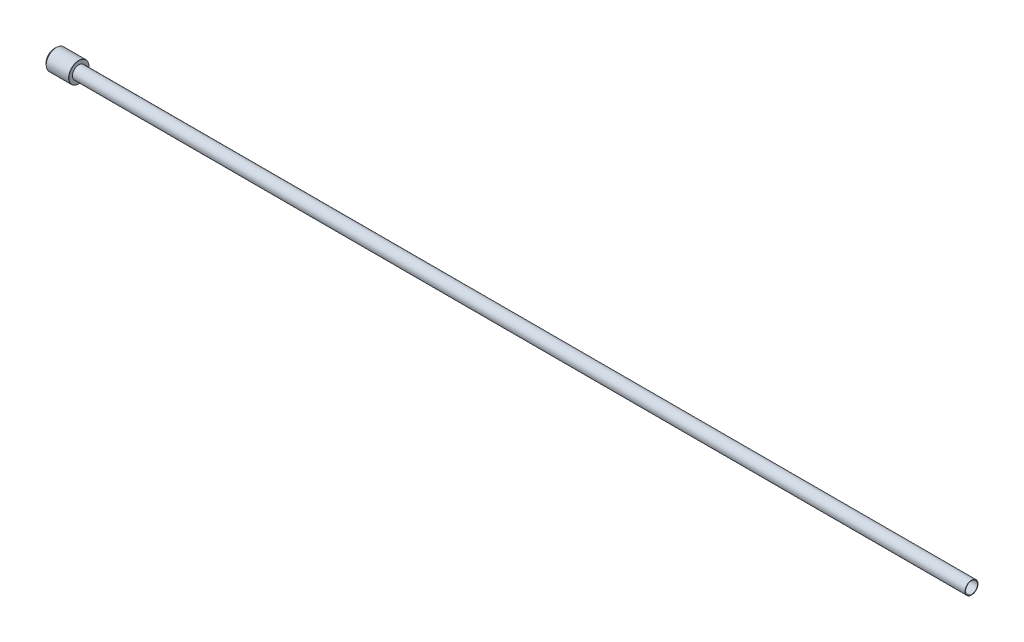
ISO-10303-21;
HEADER;
FILE_DESCRIPTION(('STEP AP214'),'2;1');
FILE_NAME('part.step','',(''),(''),'','','');
FILE_SCHEMA(('AUTOMOTIVE_DESIGN { 1 0 10303 214 1 1 1 1 }'));
ENDSEC;
DATA;
#1=APPLICATION_CONTEXT('core data for automotive mechanical design processes');
#2=APPLICATION_PROTOCOL_DEFINITION('international standard','automotive_design',2000,#1);
#3=PRODUCT_CONTEXT('',#1,'mechanical');
#4=PRODUCT('Part','Part','',(#3));
#5=PRODUCT_RELATED_PRODUCT_CATEGORY('part','',(#4));
#6=PRODUCT_DEFINITION_FORMATION('','',#4);
#7=PRODUCT_DEFINITION_CONTEXT('part definition',#1,'design');
#8=PRODUCT_DEFINITION('design','',#6,#7);
#9=PRODUCT_DEFINITION_SHAPE('','',#8);
#10=(LENGTH_UNIT() NAMED_UNIT(*) SI_UNIT(.MILLI.,.METRE.));
#11=(NAMED_UNIT(*) PLANE_ANGLE_UNIT() SI_UNIT($,.RADIAN.));
#12=(NAMED_UNIT(*) SI_UNIT($,.STERADIAN.) SOLID_ANGLE_UNIT());
#13=UNCERTAINTY_MEASURE_WITH_UNIT(LENGTH_MEASURE(1.E-05),#10,'distance_accuracy_value','');
#14=(GEOMETRIC_REPRESENTATION_CONTEXT(3) GLOBAL_UNCERTAINTY_ASSIGNED_CONTEXT((#13)) GLOBAL_UNIT_ASSIGNED_CONTEXT((#10,
#11,#12)) REPRESENTATION_CONTEXT('',''));
#15=CARTESIAN_POINT('',(0.,0.,0.));
#16=DIRECTION('',(0.,0.,1.));
#17=DIRECTION('',(1.,0.,0.));
#18=AXIS2_PLACEMENT_3D('',#15,#16,#17);
#19=CARTESIAN_POINT('',(12.,5.,0.));
#20=DIRECTION('',(-1.,0.,0.));
#21=DIRECTION('',(0.,0.,1.));
#22=AXIS2_PLACEMENT_3D('',#19,#20,#21);
#23=PLANE('',#22);
#24=CARTESIAN_POINT('',(12.,0.,0.));
#25=DIRECTION('',(-1.,0.,0.));
#26=DIRECTION('',(0.,0.,1.));
#27=AXIS2_PLACEMENT_3D('',#24,#25,#26);
#28=CIRCLE('',#27,4.9);
#29=CARTESIAN_POINT('',(12.,0.,4.9));
#30=VERTEX_POINT('',#29);
#31=EDGE_CURVE('E10',#30,#30,#28,.F.);
#32=ORIENTED_EDGE('',*,*,#31,.T.);
#33=EDGE_LOOP('',(#32));
#34=FACE_BOUND('',#33,.T.);
#35=CARTESIAN_POINT('',(12.,0.,0.));
#36=DIRECTION('',(-1.,0.,0.));
#37=DIRECTION('',(0.,0.,1.));
#38=AXIS2_PLACEMENT_3D('',#35,#36,#37);
#39=CIRCLE('',#38,3.175);
#40=CARTESIAN_POINT('',(12.,0.,3.175));
#41=VERTEX_POINT('',#40);
#42=EDGE_CURVE('E63',#41,#41,#39,.T.);
#43=ORIENTED_EDGE('',*,*,#42,.T.);
#44=EDGE_LOOP('',(#43));
#45=FACE_BOUND('',#44,.T.);
#46=ADVANCED_FACE('F31',(#34,#45),#23,.F.);
#47=CARTESIAN_POINT('',(-22.2121854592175,0.,0.));
#48=DIRECTION('',(-1.,0.,0.));
#49=DIRECTION('',(0.,0.,1.));
#50=AXIS2_PLACEMENT_3D('',#47,#48,#49);
#51=CYLINDRICAL_SURFACE('',#50,5.);
#52=CARTESIAN_POINT('',(11.9,0.,0.));
#53=DIRECTION('',(-1.,0.,0.));
#54=DIRECTION('',(0.,0.,1.));
#55=AXIS2_PLACEMENT_3D('',#52,#53,#54);
#56=CIRCLE('',#55,5.);
#57=CARTESIAN_POINT('',(11.9,0.,5.));
#58=VERTEX_POINT('',#57);
#59=EDGE_CURVE('E38',#58,#58,#56,.T.);
#60=ORIENTED_EDGE('',*,*,#59,.T.);
#61=EDGE_LOOP('',(#60));
#62=FACE_BOUND('',#61,.T.);
#63=CARTESIAN_POINT('',(0.944999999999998,0.,0.));
#64=DIRECTION('',(-1.,0.,0.));
#65=DIRECTION('',(0.,0.,1.));
#66=AXIS2_PLACEMENT_3D('',#63,#64,#65);
#67=CIRCLE('',#66,5.);
#68=CARTESIAN_POINT('',(0.944999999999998,0.,5.));
#69=VERTEX_POINT('',#68);
#70=EDGE_CURVE('E42',#69,#69,#67,.T.);
#71=ORIENTED_EDGE('',*,*,#70,.F.);
#72=EDGE_LOOP('',(#71));
#73=FACE_BOUND('',#72,.T.);
#74=ADVANCED_FACE('F101',(#62,#73),#51,.T.);
#75=CARTESIAN_POINT('',(0.944999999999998,0.,0.));
#76=DIRECTION('',(1.,0.,0.));
#77=DIRECTION('',(0.,0.,-1.));
#78=AXIS2_PLACEMENT_3D('',#75,#76,#77);
#79=CONICAL_SURFACE('',#78,5.,0.785398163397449);
#80=CARTESIAN_POINT('',(0.0999999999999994,0.,0.));
#81=DIRECTION('',(-1.,0.,0.));
#82=DIRECTION('',(0.,0.,1.));
#83=AXIS2_PLACEMENT_3D('',#80,#81,#82);
#84=CIRCLE('',#83,4.155);
#85=CARTESIAN_POINT('',(0.0999999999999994,0.,4.155));
#86=VERTEX_POINT('',#85);
#87=EDGE_CURVE('E46',#86,#86,#84,.T.);
#88=ORIENTED_EDGE('',*,*,#87,.F.);
#89=EDGE_LOOP('',(#88));
#90=FACE_BOUND('',#89,.T.);
#91=ORIENTED_EDGE('',*,*,#70,.T.);
#92=EDGE_LOOP('',(#91));
#93=FACE_BOUND('',#92,.T.);
#94=ADVANCED_FACE('F95',(#90,#93),#79,.T.);
#95=CARTESIAN_POINT('',(-22.2121854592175,0.,0.));
#96=DIRECTION('',(-1.,0.,0.));
#97=DIRECTION('',(0.,0.,1.));
#98=AXIS2_PLACEMENT_3D('',#95,#96,#97);
#99=CYLINDRICAL_SURFACE('',#98,4.155);
#100=CARTESIAN_POINT('',(0.,0.,0.));
#101=DIRECTION('',(-1.,0.,0.));
#102=DIRECTION('',(0.,0.,1.));
#103=AXIS2_PLACEMENT_3D('',#100,#101,#102);
#104=CIRCLE('',#103,4.155);
#105=CARTESIAN_POINT('',(0.,0.,4.155));
#106=VERTEX_POINT('',#105);
#107=EDGE_CURVE('E51',#106,#106,#104,.T.);
#108=ORIENTED_EDGE('',*,*,#107,.F.);
#109=EDGE_LOOP('',(#108));
#110=FACE_BOUND('',#109,.T.);
#111=ORIENTED_EDGE('',*,*,#87,.T.);
#112=EDGE_LOOP('',(#111));
#113=FACE_BOUND('',#112,.T.);
#114=ADVANCED_FACE('F89',(#110,#113),#99,.T.);
#115=CARTESIAN_POINT('',(0.,2.921,0.));
#116=DIRECTION('',(1.,0.,0.));
#117=DIRECTION('',(0.,0.,-1.));
#118=AXIS2_PLACEMENT_3D('',#115,#116,#117);
#119=PLANE('',#118);
#120=CARTESIAN_POINT('',(0.,0.,0.));
#121=DIRECTION('',(-1.,0.,0.));
#122=DIRECTION('',(0.,0.,1.));
#123=AXIS2_PLACEMENT_3D('',#120,#121,#122);
#124=CIRCLE('',#123,2.921);
#125=CARTESIAN_POINT('',(0.,0.,2.921));
#126=VERTEX_POINT('',#125);
#127=EDGE_CURVE('E54',#126,#126,#124,.T.);
#128=ORIENTED_EDGE('',*,*,#127,.F.);
#129=EDGE_LOOP('',(#128));
#130=FACE_BOUND('',#129,.T.);
#131=ORIENTED_EDGE('',*,*,#107,.T.);
#132=EDGE_LOOP('',(#131));
#133=FACE_BOUND('',#132,.T.);
#134=ADVANCED_FACE('F83',(#130,#133),#119,.F.);
#135=CARTESIAN_POINT('',(-22.2121854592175,0.,0.));
#136=DIRECTION('',(-1.,0.,0.));
#137=DIRECTION('',(0.,0.,1.));
#138=AXIS2_PLACEMENT_3D('',#135,#136,#137);
#139=CYLINDRICAL_SURFACE('',#138,2.92100000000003);
#140=CARTESIAN_POINT('',(450.,0.,0.));
#141=DIRECTION('',(-1.,0.,0.));
#142=DIRECTION('',(0.,0.,1.));
#143=AXIS2_PLACEMENT_3D('',#140,#141,#142);
#144=CIRCLE('',#143,2.92100000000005);
#145=CARTESIAN_POINT('',(450.,0.,2.92100000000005));
#146=VERTEX_POINT('',#145);
#147=EDGE_CURVE('E57',#146,#146,#144,.T.);
#148=ORIENTED_EDGE('',*,*,#147,.F.);
#149=EDGE_LOOP('',(#148));
#150=FACE_BOUND('',#149,.T.);
#151=ORIENTED_EDGE('',*,*,#127,.T.);
#152=EDGE_LOOP('',(#151));
#153=FACE_BOUND('',#152,.T.);
#154=ADVANCED_FACE('F77',(#150,#153),#139,.F.);
#155=CARTESIAN_POINT('',(450.,3.175,0.));
#156=DIRECTION('',(-1.,0.,0.));
#157=DIRECTION('',(0.,0.,1.));
#158=AXIS2_PLACEMENT_3D('',#155,#156,#157);
#159=PLANE('',#158);
#160=CARTESIAN_POINT('',(450.,0.,0.));
#161=DIRECTION('',(-1.,0.,0.));
#162=DIRECTION('',(0.,0.,1.));
#163=AXIS2_PLACEMENT_3D('',#160,#161,#162);
#164=CIRCLE('',#163,3.175);
#165=CARTESIAN_POINT('',(450.,0.,3.175));
#166=VERTEX_POINT('',#165);
#167=EDGE_CURVE('E60',#166,#166,#164,.T.);
#168=ORIENTED_EDGE('',*,*,#167,.F.);
#169=EDGE_LOOP('',(#168));
#170=FACE_BOUND('',#169,.T.);
#171=ORIENTED_EDGE('',*,*,#147,.T.);
#172=EDGE_LOOP('',(#171));
#173=FACE_BOUND('',#172,.T.);
#174=ADVANCED_FACE('F71',(#170,#173),#159,.F.);
#175=CARTESIAN_POINT('',(-22.2121854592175,0.,0.));
#176=DIRECTION('',(-1.,0.,0.));
#177=DIRECTION('',(0.,0.,1.));
#178=AXIS2_PLACEMENT_3D('',#175,#176,#177);
#179=CYLINDRICAL_SURFACE('',#178,3.175);
#180=ORIENTED_EDGE('',*,*,#42,.F.);
#181=EDGE_LOOP('',(#180));
#182=FACE_BOUND('',#181,.T.);
#183=ORIENTED_EDGE('',*,*,#167,.T.);
#184=EDGE_LOOP('',(#183));
#185=FACE_BOUND('',#184,.T.);
#186=ADVANCED_FACE('F68',(#182,#185),#179,.T.);
#187=CARTESIAN_POINT('',(11.9,0.,0.));
#188=DIRECTION('',(-1.,0.,0.));
#189=DIRECTION('',(0.,0.,1.));
#190=AXIS2_PLACEMENT_3D('',#187,#188,#189);
#191=TOROIDAL_SURFACE('',#190,4.9,0.1);
#192=ORIENTED_EDGE('',*,*,#31,.F.);
#193=EDGE_LOOP('',(#192));
#194=FACE_BOUND('',#193,.T.);
#195=ORIENTED_EDGE('',*,*,#59,.F.);
#196=EDGE_LOOP('',(#195));
#197=FACE_BOUND('',#196,.T.);
#198=ADVANCED_FACE('F33',(#194,#197),#191,.T.);
#199=CLOSED_SHELL('',(#46,#74,#94,#114,#134,#154,#174,#186,#198));
#200=MANIFOLD_SOLID_BREP('B2',#199);
#201=ADVANCED_BREP_SHAPE_REPRESENTATION('',(#18,#200),#14);
#202=SHAPE_DEFINITION_REPRESENTATION(#9,#201);
ENDSEC;
END-ISO-10303-21;
